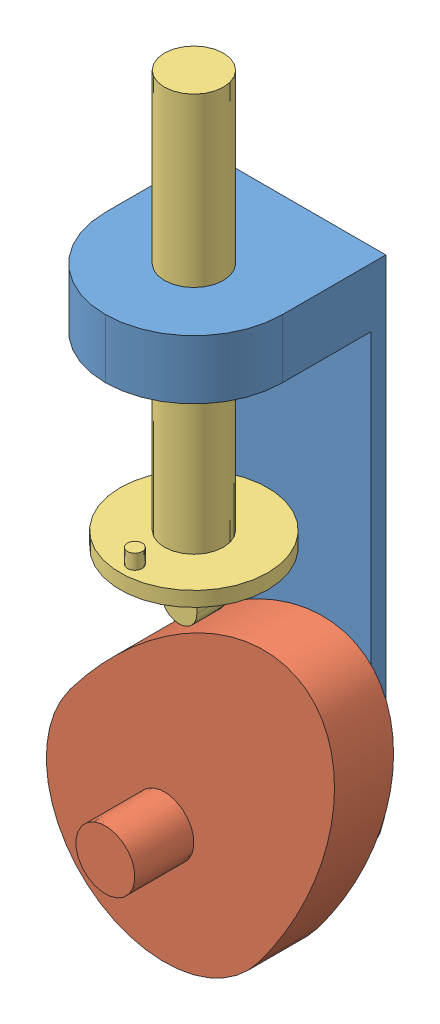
SolidWorks assembly z.SLDASM, configuration Domyślna (file format 13000). Lengths in mm.
Overall size (135.94 272.72 65).
3 component instances, 3 part files, 5 mates.
Components (placement in the parent):
- p1-1: p1.SLDPRT [Domyślna] at (-75.3269 -70.3345 137.5) size (60 190 65)
- p2-1: p2.SLDPRT [Domyślna] at (-45.3269 -70.3345 162.5) x (0.800773 -0.598968 0) z (0 0 1) size (80 120 50)
- p3-1: p3.SLDPRT [Domyślna] at (-45.3269 6.3928 172.5) size (50 160 50)
Mates (geometry in assembly coordinates):
- Koncentryczne1: concentric anti-aligned: cylinder of p1-1 through (-45.3269 -70.3345 162.5) axis (0 0 -1) radius 5; cylinder of p2-1 through (-45.3269 -70.3345 152.5) axis (0 0 1) radius 5
- Wspólnie1: coincident anti-aligned: plane of p1-1 through (-45.3269 -70.3345 152.5) normal (0 0 1); plane of p2-1 through (-45.3269 -70.3345 152.5) normal (0 0 -1)
- Koncentryczne2: concentric aligned: cylinder of p1-1 through (-45.3269 -100.3355 172.5) axis (0 1 0) radius 10; cylinder of p3-1 through (-45.3269 146.3928 172.5) axis (0 1 0) radius 10
- Równolegle1: parallel aligned: plane of p1-1 through (-75.3269 -70.3345 142.5) normal (0 0 1); plane of p3-1 through (-45.3269 6.3928 177.5) normal (0 0 1)
- Wiązanie krzywki styczne1: cam tangent: cylinder of assembly; face of p2-1; cylinder of p3-1 through (-45.3269 -7.6072 167.5) axis (0 0 1) radius 6
